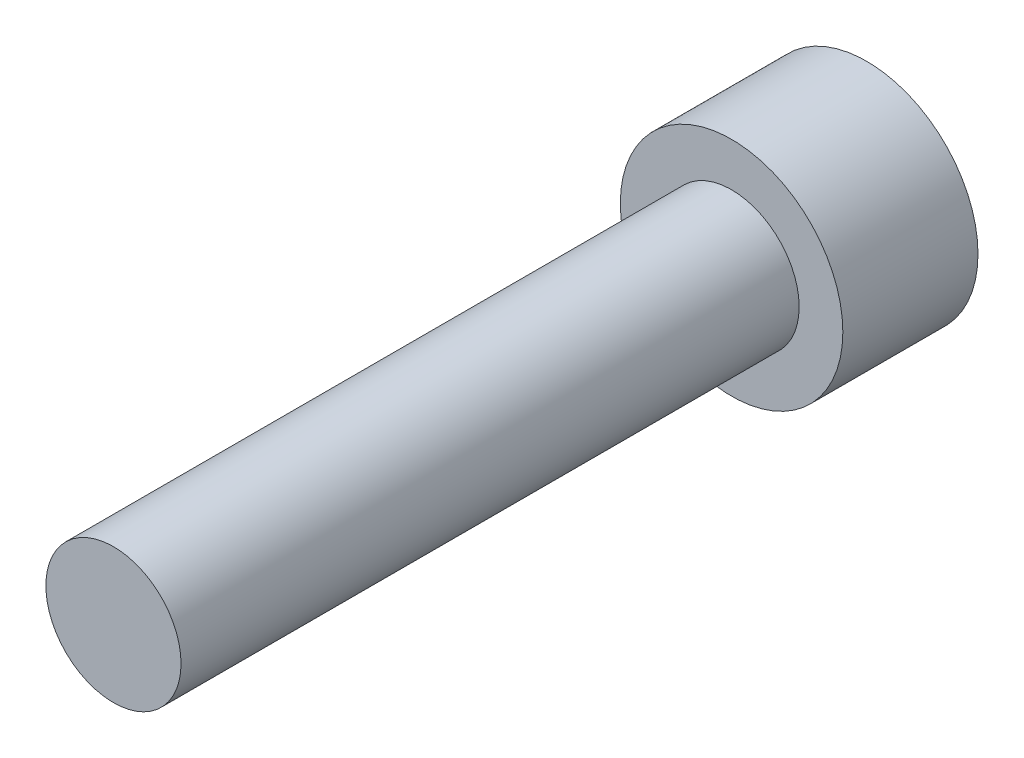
ISO-10303-21;
HEADER;
FILE_DESCRIPTION(('STEP AP214'),'2;1');
FILE_NAME('part.step','',(''),(''),'','','');
FILE_SCHEMA(('AUTOMOTIVE_DESIGN { 1 0 10303 214 1 1 1 1 }'));
ENDSEC;
DATA;
#1=APPLICATION_CONTEXT('core data for automotive mechanical design processes');
#2=APPLICATION_PROTOCOL_DEFINITION('international standard','automotive_design',2000,#1);
#3=PRODUCT_CONTEXT('',#1,'mechanical');
#4=PRODUCT('Part','Part','',(#3));
#5=PRODUCT_RELATED_PRODUCT_CATEGORY('part','',(#4));
#6=PRODUCT_DEFINITION_FORMATION('','',#4);
#7=PRODUCT_DEFINITION_CONTEXT('part definition',#1,'design');
#8=PRODUCT_DEFINITION('design','',#6,#7);
#9=PRODUCT_DEFINITION_SHAPE('','',#8);
#10=(LENGTH_UNIT() NAMED_UNIT(*) SI_UNIT(.MILLI.,.METRE.));
#11=(NAMED_UNIT(*) PLANE_ANGLE_UNIT() SI_UNIT($,.RADIAN.));
#12=(NAMED_UNIT(*) SI_UNIT($,.STERADIAN.) SOLID_ANGLE_UNIT());
#13=UNCERTAINTY_MEASURE_WITH_UNIT(LENGTH_MEASURE(1.E-05),#10,'distance_accuracy_value','');
#14=(GEOMETRIC_REPRESENTATION_CONTEXT(3) GLOBAL_UNCERTAINTY_ASSIGNED_CONTEXT((#13)) GLOBAL_UNIT_ASSIGNED_CONTEXT((#10,
#11,#12)) REPRESENTATION_CONTEXT('',''));
#15=CARTESIAN_POINT('',(0.,0.,0.));
#16=DIRECTION('',(0.,0.,1.));
#17=DIRECTION('',(1.,0.,0.));
#18=AXIS2_PLACEMENT_3D('',#15,#16,#17);
#19=CARTESIAN_POINT('',(0.,0.,19.05));
#20=DIRECTION('',(0.,0.,1.));
#21=DIRECTION('',(1.,0.,0.));
#22=AXIS2_PLACEMENT_3D('',#19,#20,#21);
#23=PLANE('',#22);
#24=CARTESIAN_POINT('',(0.,0.,19.05));
#25=DIRECTION('',(0.,0.,1.));
#26=DIRECTION('',(1.,0.,0.));
#27=AXIS2_PLACEMENT_3D('',#24,#25,#26);
#28=CIRCLE('',#27,2.0828);
#29=CARTESIAN_POINT('',(2.0828,0.,19.05));
#30=VERTEX_POINT('',#29);
#31=EDGE_CURVE('E11',#30,#30,#28,.T.);
#32=ORIENTED_EDGE('',*,*,#31,.T.);
#33=EDGE_LOOP('',(#32));
#34=FACE_BOUND('',#33,.T.);
#35=ADVANCED_FACE('F32',(#34),#23,.T.);
#36=CARTESIAN_POINT('',(0.,0.,19.05));
#37=DIRECTION('',(0.,0.,1.));
#38=DIRECTION('',(1.,0.,0.));
#39=AXIS2_PLACEMENT_3D('',#36,#37,#38);
#40=CYLINDRICAL_SURFACE('',#39,2.0828);
#41=CARTESIAN_POINT('',(0.,0.,0.));
#42=DIRECTION('',(0.,0.,1.));
#43=DIRECTION('',(1.,0.,0.));
#44=AXIS2_PLACEMENT_3D('',#41,#42,#43);
#45=CIRCLE('',#44,2.0828);
#46=CARTESIAN_POINT('',(2.0828,0.,0.));
#47=VERTEX_POINT('',#46);
#48=EDGE_CURVE('E39',#47,#47,#45,.T.);
#49=ORIENTED_EDGE('',*,*,#48,.T.);
#50=EDGE_LOOP('',(#49));
#51=FACE_BOUND('',#50,.T.);
#52=ORIENTED_EDGE('',*,*,#31,.F.);
#53=EDGE_LOOP('',(#52));
#54=FACE_BOUND('',#53,.T.);
#55=ADVANCED_FACE('F146',(#51,#54),#40,.T.);
#56=CARTESIAN_POINT('',(0.,-2.0828,0.));
#57=DIRECTION('',(0.,0.,1.));
#58=DIRECTION('',(1.,0.,0.));
#59=AXIS2_PLACEMENT_3D('',#56,#57,#58);
#60=PLANE('',#59);
#61=CARTESIAN_POINT('',(0.,0.,0.));
#62=DIRECTION('',(0.,0.,1.));
#63=DIRECTION('',(1.,0.,0.));
#64=AXIS2_PLACEMENT_3D('',#61,#62,#63);
#65=CIRCLE('',#64,3.429);
#66=CARTESIAN_POINT('',(3.429,0.,0.));
#67=VERTEX_POINT('',#66);
#68=EDGE_CURVE('E141',#67,#67,#65,.T.);
#69=ORIENTED_EDGE('',*,*,#68,.T.);
#70=EDGE_LOOP('',(#69));
#71=FACE_BOUND('',#70,.T.);
#72=ORIENTED_EDGE('',*,*,#48,.F.);
#73=EDGE_LOOP('',(#72));
#74=FACE_BOUND('',#73,.T.);
#75=ADVANCED_FACE('F149',(#71,#74),#60,.T.);
#76=CARTESIAN_POINT('',(0.,0.,19.05));
#77=DIRECTION('',(0.,0.,1.));
#78=DIRECTION('',(1.,0.,0.));
#79=AXIS2_PLACEMENT_3D('',#76,#77,#78);
#80=CYLINDRICAL_SURFACE('',#79,3.429);
#81=CARTESIAN_POINT('',(0.,0.,-4.1656));
#82=DIRECTION('',(0.,0.,1.));
#83=DIRECTION('',(1.,0.,0.));
#84=AXIS2_PLACEMENT_3D('',#81,#82,#83);
#85=CIRCLE('',#84,3.429);
#86=CARTESIAN_POINT('',(3.429,0.,-4.1656));
#87=VERTEX_POINT('',#86);
#88=EDGE_CURVE('E133',#87,#87,#85,.T.);
#89=ORIENTED_EDGE('',*,*,#88,.T.);
#90=EDGE_LOOP('',(#89));
#91=FACE_BOUND('',#90,.T.);
#92=ORIENTED_EDGE('',*,*,#68,.F.);
#93=EDGE_LOOP('',(#92));
#94=FACE_BOUND('',#93,.T.);
#95=ADVANCED_FACE('F151',(#91,#94),#80,.T.);
#96=CARTESIAN_POINT('',(0.,-3.429,-4.1656));
#97=DIRECTION('',(0.,0.,-1.));
#98=DIRECTION('',(-1.,0.,0.));
#99=AXIS2_PLACEMENT_3D('',#96,#97,#98);
#100=PLANE('',#99);
#101=DIRECTION('',(0.866025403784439,-0.5,0.));
#102=VECTOR('',#101,1.);
#103=CARTESIAN_POINT('',(0.,2.05305755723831,-4.1656));
#104=LINE('',#103,#102);
#105=CARTESIAN_POINT('',(0.,2.05305755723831,-4.1656));
#106=VERTEX_POINT('',#105);
#107=CARTESIAN_POINT('',(1.778,1.02652877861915,-4.1656));
#108=VERTEX_POINT('',#107);
#109=EDGE_CURVE('E46',#106,#108,#104,.T.);
#110=ORIENTED_EDGE('',*,*,#109,.F.);
#111=DIRECTION('',(0.866025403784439,0.5,0.));
#112=VECTOR('',#111,1.);
#113=CARTESIAN_POINT('',(-1.778,1.02652877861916,-4.1656));
#114=LINE('',#113,#112);
#115=CARTESIAN_POINT('',(-1.778,1.02652877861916,-4.1656));
#116=VERTEX_POINT('',#115);
#117=EDGE_CURVE('E129',#116,#106,#114,.T.);
#118=ORIENTED_EDGE('',*,*,#117,.F.);
#119=DIRECTION('',(0.,1.,0.));
#120=VECTOR('',#119,1.);
#121=CARTESIAN_POINT('',(-1.778,-1.02652877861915,-4.1656));
#122=LINE('',#121,#120);
#123=CARTESIAN_POINT('',(-1.778,-1.02652877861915,-4.1656));
#124=VERTEX_POINT('',#123);
#125=EDGE_CURVE('E127',#124,#116,#122,.T.);
#126=ORIENTED_EDGE('',*,*,#125,.F.);
#127=DIRECTION('',(-0.866025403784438,0.5,0.));
#128=VECTOR('',#127,1.);
#129=CARTESIAN_POINT('',(0.,-2.05305755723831,-4.1656));
#130=LINE('',#129,#128);
#131=CARTESIAN_POINT('',(0.,-2.05305755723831,-4.1656));
#132=VERTEX_POINT('',#131);
#133=EDGE_CURVE('E94',#132,#124,#130,.T.);
#134=ORIENTED_EDGE('',*,*,#133,.F.);
#135=DIRECTION('',(-0.866025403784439,-0.5,0.));
#136=VECTOR('',#135,1.);
#137=CARTESIAN_POINT('',(1.778,-1.02652877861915,-4.1656));
#138=LINE('',#137,#136);
#139=CARTESIAN_POINT('',(1.778,-1.02652877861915,-4.1656));
#140=VERTEX_POINT('',#139);
#141=EDGE_CURVE('E123',#140,#132,#138,.T.);
#142=ORIENTED_EDGE('',*,*,#141,.F.);
#143=DIRECTION('',(0.,-1.,0.));
#144=VECTOR('',#143,1.);
#145=CARTESIAN_POINT('',(1.778,1.02652877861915,-4.1656));
#146=LINE('',#145,#144);
#147=EDGE_CURVE('E120',#108,#140,#146,.T.);
#148=ORIENTED_EDGE('',*,*,#147,.F.);
#149=EDGE_LOOP('',(#110,#118,#126,#134,#142,#148));
#150=FACE_BOUND('',#149,.T.);
#151=ORIENTED_EDGE('',*,*,#88,.F.);
#152=EDGE_LOOP('',(#151));
#153=FACE_BOUND('',#152,.T.);
#154=ADVANCED_FACE('F158',(#150,#153),#100,.T.);
#155=CARTESIAN_POINT('',(0.,2.05305755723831,-1.3716));
#156=DIRECTION('',(0.5,0.866025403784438,0.));
#157=DIRECTION('',(-0.866025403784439,0.5,0.));
#158=AXIS2_PLACEMENT_3D('',#155,#156,#157);
#159=PLANE('',#158);
#160=ORIENTED_EDGE('',*,*,#109,.T.);
#161=DIRECTION('',(0.,0.,-1.));
#162=VECTOR('',#161,1.);
#163=CARTESIAN_POINT('',(1.778,1.02652877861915,-1.3716));
#164=LINE('',#163,#162);
#165=CARTESIAN_POINT('',(1.778,1.02652877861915,-1.3716));
#166=VERTEX_POINT('',#165);
#167=EDGE_CURVE('E76',#166,#108,#164,.T.);
#168=ORIENTED_EDGE('',*,*,#167,.F.);
#169=DIRECTION('',(0.866025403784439,-0.5,0.));
#170=VECTOR('',#169,1.);
#171=CARTESIAN_POINT('',(0.,2.05305755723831,-1.3716));
#172=LINE('',#171,#170);
#173=CARTESIAN_POINT('',(0.,2.05305755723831,-1.3716));
#174=VERTEX_POINT('',#173);
#175=EDGE_CURVE('E131',#174,#166,#172,.T.);
#176=ORIENTED_EDGE('',*,*,#175,.F.);
#177=DIRECTION('',(0.,0.,-1.));
#178=VECTOR('',#177,1.);
#179=CARTESIAN_POINT('',(0.,2.05305755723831,-1.3716));
#180=LINE('',#179,#178);
#181=EDGE_CURVE('E54',#174,#106,#180,.T.);
#182=ORIENTED_EDGE('',*,*,#181,.T.);
#183=EDGE_LOOP('',(#160,#168,#176,#182));
#184=FACE_BOUND('',#183,.T.);
#185=ADVANCED_FACE('F189',(#184),#159,.F.);
#186=CARTESIAN_POINT('',(-1.778,1.02652877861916,-1.3716));
#187=DIRECTION('',(-0.5,0.866025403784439,0.));
#188=DIRECTION('',(-0.866025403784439,-0.5,0.));
#189=AXIS2_PLACEMENT_3D('',#186,#187,#188);
#190=PLANE('',#189);
#191=ORIENTED_EDGE('',*,*,#117,.T.);
#192=ORIENTED_EDGE('',*,*,#181,.F.);
#193=DIRECTION('',(0.866025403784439,0.5,0.));
#194=VECTOR('',#193,1.);
#195=CARTESIAN_POINT('',(-1.778,1.02652877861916,-1.3716));
#196=LINE('',#195,#194);
#197=CARTESIAN_POINT('',(-1.778,1.02652877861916,-1.3716));
#198=VERTEX_POINT('',#197);
#199=EDGE_CURVE('E106',#198,#174,#196,.T.);
#200=ORIENTED_EDGE('',*,*,#199,.F.);
#201=DIRECTION('',(0.,0.,-1.));
#202=VECTOR('',#201,1.);
#203=CARTESIAN_POINT('',(-1.778,1.02652877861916,-1.3716));
#204=LINE('',#203,#202);
#205=EDGE_CURVE('E98',#198,#116,#204,.T.);
#206=ORIENTED_EDGE('',*,*,#205,.T.);
#207=EDGE_LOOP('',(#191,#192,#200,#206));
#208=FACE_BOUND('',#207,.T.);
#209=ADVANCED_FACE('F199',(#208),#190,.F.);
#210=CARTESIAN_POINT('',(-1.778,-1.02652877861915,-1.3716));
#211=DIRECTION('',(-1.,0.,0.));
#212=DIRECTION('',(0.,0.,1.));
#213=AXIS2_PLACEMENT_3D('',#210,#211,#212);
#214=PLANE('',#213);
#215=ORIENTED_EDGE('',*,*,#125,.T.);
#216=ORIENTED_EDGE('',*,*,#205,.F.);
#217=DIRECTION('',(0.,1.,0.));
#218=VECTOR('',#217,1.);
#219=CARTESIAN_POINT('',(-1.778,-1.02652877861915,-1.3716));
#220=LINE('',#219,#218);
#221=CARTESIAN_POINT('',(-1.778,-1.02652877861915,-1.3716));
#222=VERTEX_POINT('',#221);
#223=EDGE_CURVE('E102',#222,#198,#220,.T.);
#224=ORIENTED_EDGE('',*,*,#223,.F.);
#225=DIRECTION('',(0.,0.,-1.));
#226=VECTOR('',#225,1.);
#227=CARTESIAN_POINT('',(-1.778,-1.02652877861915,-1.3716));
#228=LINE('',#227,#226);
#229=EDGE_CURVE('E87',#222,#124,#228,.T.);
#230=ORIENTED_EDGE('',*,*,#229,.T.);
#231=EDGE_LOOP('',(#215,#216,#224,#230));
#232=FACE_BOUND('',#231,.T.);
#233=ADVANCED_FACE('F103',(#232),#214,.F.);
#234=CARTESIAN_POINT('',(0.,-2.05305755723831,-1.3716));
#235=DIRECTION('',(-0.5,-0.866025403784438,0.));
#236=DIRECTION('',(0.866025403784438,-0.5,0.));
#237=AXIS2_PLACEMENT_3D('',#234,#235,#236);
#238=PLANE('',#237);
#239=ORIENTED_EDGE('',*,*,#133,.T.);
#240=ORIENTED_EDGE('',*,*,#229,.F.);
#241=DIRECTION('',(-0.866025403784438,0.5,0.));
#242=VECTOR('',#241,1.);
#243=CARTESIAN_POINT('',(0.,-2.05305755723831,-1.3716));
#244=LINE('',#243,#242);
#245=CARTESIAN_POINT('',(0.,-2.05305755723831,-1.3716));
#246=VERTEX_POINT('',#245);
#247=EDGE_CURVE('E91',#246,#222,#244,.T.);
#248=ORIENTED_EDGE('',*,*,#247,.F.);
#249=DIRECTION('',(0.,0.,-1.));
#250=VECTOR('',#249,1.);
#251=CARTESIAN_POINT('',(0.,-2.05305755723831,-1.3716));
#252=LINE('',#251,#250);
#253=EDGE_CURVE('E99',#246,#132,#252,.T.);
#254=ORIENTED_EDGE('',*,*,#253,.T.);
#255=EDGE_LOOP('',(#239,#240,#248,#254));
#256=FACE_BOUND('',#255,.T.);
#257=ADVANCED_FACE('F89',(#256),#238,.F.);
#258=CARTESIAN_POINT('',(1.778,-1.02652877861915,-1.3716));
#259=DIRECTION('',(0.5,-0.866025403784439,0.));
#260=DIRECTION('',(0.866025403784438,0.5,0.));
#261=AXIS2_PLACEMENT_3D('',#258,#259,#260);
#262=PLANE('',#261);
#263=ORIENTED_EDGE('',*,*,#141,.T.);
#264=ORIENTED_EDGE('',*,*,#253,.F.);
#265=DIRECTION('',(-0.866025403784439,-0.5,0.));
#266=VECTOR('',#265,1.);
#267=CARTESIAN_POINT('',(1.778,-1.02652877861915,-1.3716));
#268=LINE('',#267,#266);
#269=CARTESIAN_POINT('',(1.778,-1.02652877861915,-1.3716));
#270=VERTEX_POINT('',#269);
#271=EDGE_CURVE('E112',#270,#246,#268,.T.);
#272=ORIENTED_EDGE('',*,*,#271,.F.);
#273=DIRECTION('',(0.,0.,-1.));
#274=VECTOR('',#273,1.);
#275=CARTESIAN_POINT('',(1.778,-1.02652877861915,-1.3716));
#276=LINE('',#275,#274);
#277=EDGE_CURVE('E136',#270,#140,#276,.T.);
#278=ORIENTED_EDGE('',*,*,#277,.T.);
#279=EDGE_LOOP('',(#263,#264,#272,#278));
#280=FACE_BOUND('',#279,.T.);
#281=ADVANCED_FACE('F224',(#280),#262,.F.);
#282=CARTESIAN_POINT('',(1.778,1.02652877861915,-1.3716));
#283=DIRECTION('',(1.,0.,0.));
#284=DIRECTION('',(0.,0.,-1.));
#285=AXIS2_PLACEMENT_3D('',#282,#283,#284);
#286=PLANE('',#285);
#287=ORIENTED_EDGE('',*,*,#147,.T.);
#288=ORIENTED_EDGE('',*,*,#277,.F.);
#289=DIRECTION('',(0.,-1.,0.));
#290=VECTOR('',#289,1.);
#291=CARTESIAN_POINT('',(1.778,1.02652877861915,-1.3716));
#292=LINE('',#291,#290);
#293=EDGE_CURVE('E114',#166,#270,#292,.T.);
#294=ORIENTED_EDGE('',*,*,#293,.F.);
#295=ORIENTED_EDGE('',*,*,#167,.T.);
#296=EDGE_LOOP('',(#287,#288,#294,#295));
#297=FACE_BOUND('',#296,.T.);
#298=ADVANCED_FACE('F233',(#297),#286,.F.);
#299=CARTESIAN_POINT('',(3.556,0.,-1.3716));
#300=DIRECTION('',(0.,0.,-1.));
#301=DIRECTION('',(-1.,0.,0.));
#302=AXIS2_PLACEMENT_3D('',#299,#300,#301);
#303=PLANE('',#302);
#304=ORIENTED_EDGE('',*,*,#175,.T.);
#305=ORIENTED_EDGE('',*,*,#293,.T.);
#306=ORIENTED_EDGE('',*,*,#271,.T.);
#307=ORIENTED_EDGE('',*,*,#247,.T.);
#308=ORIENTED_EDGE('',*,*,#223,.T.);
#309=ORIENTED_EDGE('',*,*,#199,.T.);
#310=EDGE_LOOP('',(#304,#305,#306,#307,#308,#309));
#311=FACE_BOUND('',#310,.T.);
#312=ADVANCED_FACE('F109',(#311),#303,.T.);
#313=CLOSED_SHELL('',(#35,#55,#75,#95,#154,#185,#209,#233,#257,#281,#298,#312));
#314=MANIFOLD_SOLID_BREP('B2',#313);
#315=ADVANCED_BREP_SHAPE_REPRESENTATION('',(#18,#314),#14);
#316=SHAPE_DEFINITION_REPRESENTATION(#9,#315);
ENDSEC;
END-ISO-10303-21;
